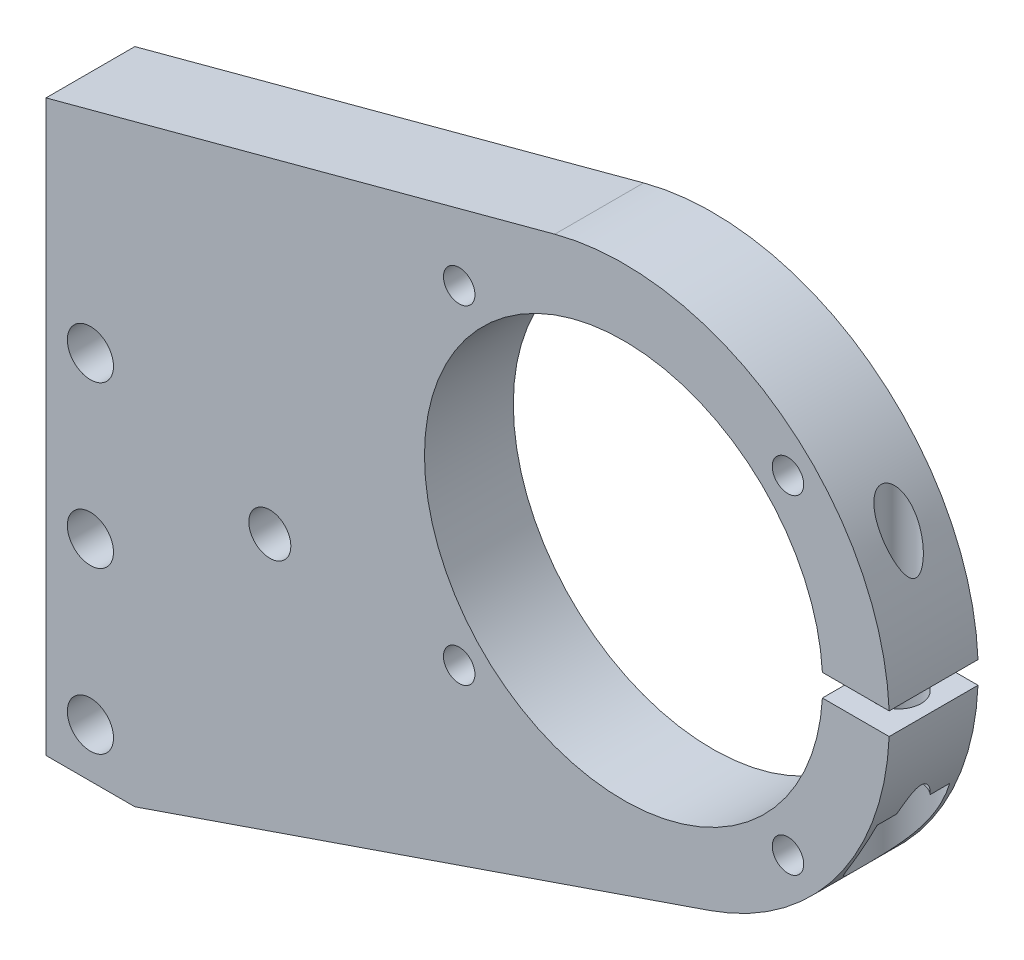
from build123d import *

# Parameters (mm, degrees)
BOSS_EXTRUDE1_DEPTH        = 12.7
CUT_EXTRUDE1_DEPTH         = 270.19769127
SKETCH3_W                  = 28.4654
SKETCH3_H                  = 12.7
F_8_CLEARANCE_HOLE1_D      = 4.5
F_1_4_CLEARANCE_HOLE1_D    = 6.6
F_12_CLEARANCE_HOLE1_D     = 6
HOLE1_D                    = 6.4
HOLE1_DEPTH                = 24.77643101
HOLE1_CBORE_D              = 11.2
HOLE1_CBORE_DEPTH          = 11.77643101
F_10_CLEARANCE_HOLE1_D     = 5
F_10_CLEARANCE_HOLE1_DEPTH = 36.4125
CHAMFER1_SIZE              = 3


with BuildPart() as part:
    # Sketch1 → Boss-Extrude1 (new body)
    with BuildSketch(Plane(origin=(0, 0, 0), x_dir=(-1, 0, 0), z_dir=(0, 0, -1))):
        with BuildLine():
            Line((224.169455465, 127.72254562), (151.435240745, 147.211619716))
            ThreePointArc((151.435240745, 147.211619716), (105.257753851, 121.607458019), (129.246532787, 74.570537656))
            Line((129.246532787, 74.570537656), (211.469455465, 46.304993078))
            Line((211.469455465, 46.304993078), (224.169455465, 46.304993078))
            Line((224.169455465, 46.304993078), (224.169455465, 127.72254562))
        make_face()
    extrude(amount=-BOSS_EXTRUDE1_DEPTH)

    # Sketch2 → Cut-Extrude1 (cut, through all)
    with BuildSketch(Plane.XY.offset(12.7)):
        with BuildLine():
            Line((-103.633291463, 112.093938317), (-113.179018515, 112.093938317))
            ThreePointArc((-113.179018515, 112.093938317), (-113.134717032, 110.506438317), (-113.179018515, 108.918938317))
            Line((-113.179018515, 108.918938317), (-103.633291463, 108.918938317))
            ThreePointArc((-103.633291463, 108.918938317), (-103.600117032, 110.506438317), (-103.633291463, 112.093938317))
        make_face()
    extrude(amount=-CUT_EXTRUDE1_DEPTH, mode=Mode.SUBTRACT)

    # Sketch3 → Cut-Revolve1 (revolve, cut)
    with BuildSketch(Plane(origin=(0, 110.506438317, 0), x_dir=(1, 0, 0), z_dir=(0, 1, 0))):
        with Locations((-127.367417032, -6.35)):
            Rectangle(SKETCH3_W, SKETCH3_H)
    revolve(axis=Axis((-141.600117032, 110.506438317, 0), (0, 0, 1)), mode=Mode.SUBTRACT)

    # 8 Clearance Hole1 (through all)
    with Locations(Plane.XY.offset(12.7)):
        with Locations((-118.100117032, 87.006438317), (-165.100117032, 87.006438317), (-165.100117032, 134.006438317), (-118.100117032, 134.006438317)):
            Hole(F_8_CLEARANCE_HOLE1_D / 2)

    # 1_4 Clearance Hole1 (through all)
    with Locations(Plane(origin=(0, 0, 0), x_dir=(-1, 0, 0), z_dir=(0, 0, -1))):
        with Locations((217.819455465, 53.304993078), (217.819455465, 76.304993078), (217.819455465, 99.304993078)):
            Hole(F_1_4_CLEARANCE_HOLE1_D / 2)

    # 12 Clearance Hole1 (through all)
    with Locations(Plane.XY.offset(12.7)):
        with Locations((-192.169455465, 89.72254562)):
            Hole(F_12_CLEARANCE_HOLE1_D / 2)

    # Hole1
    with Locations(Plane(origin=(0, 84.142507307, 0), x_dir=(-1, 0, 0), z_dir=(0, -1, 0))):
        with Locations((108.633291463, -6.35)):
            CounterBoreHole(HOLE1_D / 2, HOLE1_CBORE_D / 2, HOLE1_CBORE_DEPTH, depth=HOLE1_DEPTH)

    # 10 Clearance Hole1
    with Locations(Plane(origin=(0, 112.093938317, 0), x_dir=(-1, 0, 0), z_dir=(0, -1, 0))):
        with Locations((108.633291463, -6.35)):
            Hole(F_10_CLEARANCE_HOLE1_D / 2, depth=F_10_CLEARANCE_HOLE1_DEPTH)

    # Chamfer1
    chamfer1_edges = [part.edges().sort_by_distance(p)[0] for p in [
        (-221.119455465, 99.304993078, 0),
        (-221.119455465, 76.304993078, 0),
        (-221.119455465, 53.304993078, 0),
    ]]
    chamfer(chamfer1_edges, length=CHAMFER1_SIZE)


solid = part.part
